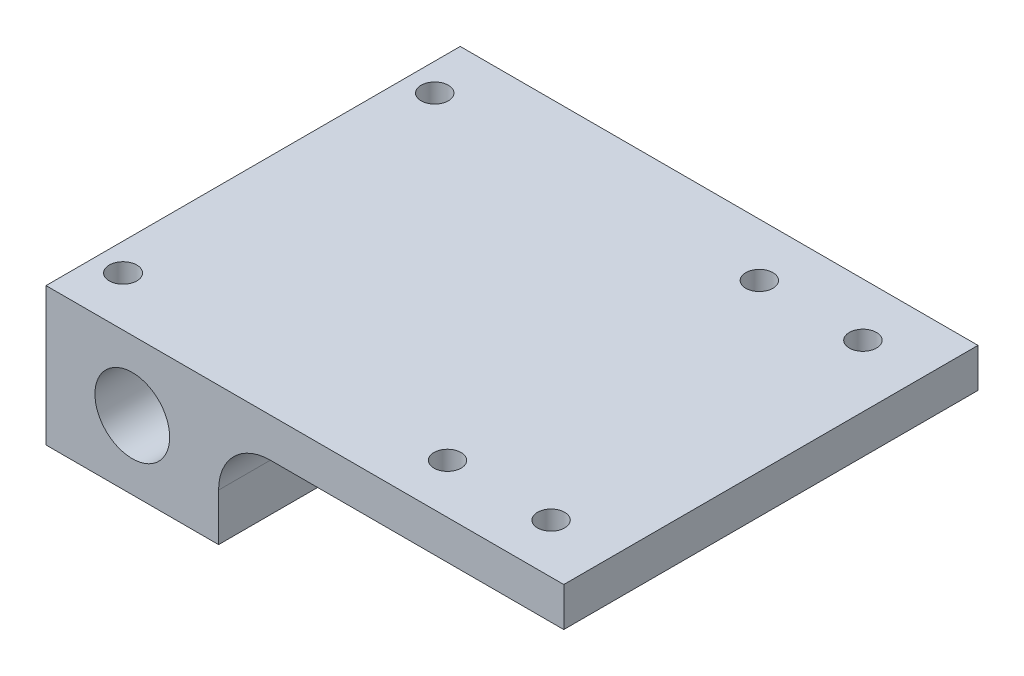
ISO-10303-21;
HEADER;
FILE_DESCRIPTION(('STEP AP214'),'2;1');
FILE_NAME('part.step','',(''),(''),'','','');
FILE_SCHEMA(('AUTOMOTIVE_DESIGN { 1 0 10303 214 1 1 1 1 }'));
ENDSEC;
DATA;
#1=APPLICATION_CONTEXT('core data for automotive mechanical design processes');
#2=APPLICATION_PROTOCOL_DEFINITION('international standard','automotive_design',2000,#1);
#3=PRODUCT_CONTEXT('',#1,'mechanical');
#4=PRODUCT('Part','Part','',(#3));
#5=PRODUCT_RELATED_PRODUCT_CATEGORY('part','',(#4));
#6=PRODUCT_DEFINITION_FORMATION('','',#4);
#7=PRODUCT_DEFINITION_CONTEXT('part definition',#1,'design');
#8=PRODUCT_DEFINITION('design','',#6,#7);
#9=PRODUCT_DEFINITION_SHAPE('','',#8);
#10=(LENGTH_UNIT() NAMED_UNIT(*) SI_UNIT(.MILLI.,.METRE.));
#11=(NAMED_UNIT(*) PLANE_ANGLE_UNIT() SI_UNIT($,.RADIAN.));
#12=(NAMED_UNIT(*) SI_UNIT($,.STERADIAN.) SOLID_ANGLE_UNIT());
#13=UNCERTAINTY_MEASURE_WITH_UNIT(LENGTH_MEASURE(1.E-05),#10,'distance_accuracy_value','');
#14=(GEOMETRIC_REPRESENTATION_CONTEXT(3) GLOBAL_UNCERTAINTY_ASSIGNED_CONTEXT((#13)) GLOBAL_UNIT_ASSIGNED_CONTEXT((#10,
#11,#12)) REPRESENTATION_CONTEXT('',''));
#15=CARTESIAN_POINT('',(0.,0.,0.));
#16=DIRECTION('',(0.,0.,1.));
#17=DIRECTION('',(1.,0.,0.));
#18=AXIS2_PLACEMENT_3D('',#15,#16,#17);
#19=CARTESIAN_POINT('',(-27.1241721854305,-5.05056291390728,30.48));
#20=DIRECTION('',(1.,0.,0.));
#21=DIRECTION('',(0.,0.,-1.));
#22=AXIS2_PLACEMENT_3D('',#19,#20,#21);
#23=PLANE('',#22);
#24=DIRECTION('',(0.,-1.,0.));
#25=VECTOR('',#24,1.);
#26=CARTESIAN_POINT('',(-27.1241721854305,-5.05056291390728,0.));
#27=LINE('',#26,#25);
#28=CARTESIAN_POINT('',(-27.1241721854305,5.10943708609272,0.));
#29=VERTEX_POINT('',#28);
#30=CARTESIAN_POINT('',(-27.1241721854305,-5.05056291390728,0.));
#31=VERTEX_POINT('',#30);
#32=EDGE_CURVE('E124',#29,#31,#27,.T.);
#33=ORIENTED_EDGE('',*,*,#32,.T.);
#34=DIRECTION('',(0.,0.,-1.));
#35=VECTOR('',#34,1.);
#36=CARTESIAN_POINT('',(-27.1241721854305,-5.05056291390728,30.48));
#37=LINE('',#36,#35);
#38=CARTESIAN_POINT('',(-27.1241721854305,-5.05056291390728,30.48));
#39=VERTEX_POINT('',#38);
#40=EDGE_CURVE('E11',#39,#31,#37,.T.);
#41=ORIENTED_EDGE('',*,*,#40,.F.);
#42=DIRECTION('',(0.,-1.,0.));
#43=VECTOR('',#42,1.);
#44=CARTESIAN_POINT('',(-27.1241721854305,-5.05056291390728,30.48));
#45=LINE('',#44,#43);
#46=CARTESIAN_POINT('',(-27.1241721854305,5.10943708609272,30.48));
#47=VERTEX_POINT('',#46);
#48=EDGE_CURVE('E136',#47,#39,#45,.T.);
#49=ORIENTED_EDGE('',*,*,#48,.F.);
#50=DIRECTION('',(0.,0.,-1.));
#51=VECTOR('',#50,1.);
#52=CARTESIAN_POINT('',(-27.1241721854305,5.10943708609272,30.48));
#53=LINE('',#52,#51);
#54=EDGE_CURVE('E120',#47,#29,#53,.T.);
#55=ORIENTED_EDGE('',*,*,#54,.T.);
#56=EDGE_LOOP('',(#33,#41,#49,#55));
#57=FACE_BOUND('',#56,.T.);
#58=ADVANCED_FACE('F33',(#57),#23,.F.);
#59=CARTESIAN_POINT('',(-14.4241721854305,-5.05056291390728,30.48));
#60=DIRECTION('',(0.,1.,0.));
#61=DIRECTION('',(-1.,0.,0.));
#62=AXIS2_PLACEMENT_3D('',#59,#60,#61);
#63=PLANE('',#62);
#64=CARTESIAN_POINT('',(-25.0921721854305,-5.05056291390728,3.90908800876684));
#65=DIRECTION('',(0.,1.,0.));
#66=DIRECTION('',(-1.,0.,0.));
#67=AXIS2_PLACEMENT_3D('',#64,#65,#66);
#68=CIRCLE('',#67,1.);
#69=CARTESIAN_POINT('',(-26.0921721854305,-5.05056291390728,3.90908800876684));
#70=VERTEX_POINT('',#69);
#71=EDGE_CURVE('E169',#70,#70,#68,.T.);
#72=ORIENTED_EDGE('',*,*,#71,.T.);
#73=EDGE_LOOP('',(#72));
#74=FACE_BOUND('',#73,.T.);
#75=CARTESIAN_POINT('',(-25.0921721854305,-5.05056291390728,26.8423791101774));
#76=DIRECTION('',(0.,1.,0.));
#77=DIRECTION('',(-1.,0.,0.));
#78=AXIS2_PLACEMENT_3D('',#75,#76,#77);
#79=CIRCLE('',#78,1.016);
#80=CARTESIAN_POINT('',(-26.1081721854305,-5.05056291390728,26.8423791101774));
#81=VERTEX_POINT('',#80);
#82=EDGE_CURVE('E163',#81,#81,#79,.T.);
#83=ORIENTED_EDGE('',*,*,#82,.T.);
#84=EDGE_LOOP('',(#83));
#85=FACE_BOUND('',#84,.T.);
#86=DIRECTION('',(1.,0.,0.));
#87=VECTOR('',#86,1.);
#88=CARTESIAN_POINT('',(-14.4241721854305,-5.05056291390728,0.));
#89=LINE('',#88,#87);
#90=CARTESIAN_POINT('',(-14.4241721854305,-5.05056291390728,0.));
#91=VERTEX_POINT('',#90);
#92=EDGE_CURVE('E127',#31,#91,#89,.T.);
#93=ORIENTED_EDGE('',*,*,#92,.T.);
#94=DIRECTION('',(0.,0.,-1.));
#95=VECTOR('',#94,1.);
#96=CARTESIAN_POINT('',(-14.4241721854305,-5.05056291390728,30.48));
#97=LINE('',#96,#95);
#98=CARTESIAN_POINT('',(-14.4241721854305,-5.05056291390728,30.48));
#99=VERTEX_POINT('',#98);
#100=EDGE_CURVE('E42',#99,#91,#97,.T.);
#101=ORIENTED_EDGE('',*,*,#100,.F.);
#102=DIRECTION('',(1.,0.,0.));
#103=VECTOR('',#102,1.);
#104=CARTESIAN_POINT('',(-14.4241721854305,-5.05056291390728,30.48));
#105=LINE('',#104,#103);
#106=EDGE_CURVE('E90',#39,#99,#105,.T.);
#107=ORIENTED_EDGE('',*,*,#106,.F.);
#108=ORIENTED_EDGE('',*,*,#40,.T.);
#109=EDGE_LOOP('',(#93,#101,#107,#108));
#110=FACE_BOUND('',#109,.T.);
#111=ADVANCED_FACE('F225',(#74,#85,#110),#63,.F.);
#112=CARTESIAN_POINT('',(-14.4241721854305,-1.57278145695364,30.48));
#113=DIRECTION('',(-1.,0.,0.));
#114=DIRECTION('',(0.,-1.,0.));
#115=AXIS2_PLACEMENT_3D('',#112,#113,#114);
#116=PLANE('',#115);
#117=DIRECTION('',(0.,1.,0.));
#118=VECTOR('',#117,1.);
#119=CARTESIAN_POINT('',(-14.4241721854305,-1.57278145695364,0.));
#120=LINE('',#119,#118);
#121=CARTESIAN_POINT('',(-14.4241721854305,-1.57278145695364,0.));
#122=VERTEX_POINT('',#121);
#123=EDGE_CURVE('E129',#91,#122,#120,.T.);
#124=ORIENTED_EDGE('',*,*,#123,.T.);
#125=DIRECTION('',(0.,0.,-1.));
#126=VECTOR('',#125,1.);
#127=CARTESIAN_POINT('',(-14.4241721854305,-1.57278145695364,30.48));
#128=LINE('',#127,#126);
#129=CARTESIAN_POINT('',(-14.4241721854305,-1.57278145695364,30.48));
#130=VERTEX_POINT('',#129);
#131=EDGE_CURVE('E140',#130,#122,#128,.T.);
#132=ORIENTED_EDGE('',*,*,#131,.F.);
#133=DIRECTION('',(0.,1.,0.));
#134=VECTOR('',#133,1.);
#135=CARTESIAN_POINT('',(-14.4241721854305,-1.57278145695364,30.48));
#136=LINE('',#135,#134);
#137=EDGE_CURVE('E149',#99,#130,#136,.T.);
#138=ORIENTED_EDGE('',*,*,#137,.F.);
#139=ORIENTED_EDGE('',*,*,#100,.T.);
#140=EDGE_LOOP('',(#124,#132,#138,#139));
#141=FACE_BOUND('',#140,.T.);
#142=ADVANCED_FACE('F147',(#141),#116,.F.);
#143=CARTESIAN_POINT('',(-10.6141721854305,-1.57278145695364,30.48));
#144=DIRECTION('',(0.,0.,-1.));
#145=DIRECTION('',(-1.,0.,0.));
#146=AXIS2_PLACEMENT_3D('',#143,#144,#145);
#147=CYLINDRICAL_SURFACE('',#146,3.81);
#148=CARTESIAN_POINT('',(-10.6141721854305,-1.57278145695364,0.));
#149=DIRECTION('',(0.,0.,-1.));
#150=DIRECTION('',(1.,0.,0.));
#151=AXIS2_PLACEMENT_3D('',#148,#149,#150);
#152=CIRCLE('',#151,3.81);
#153=CARTESIAN_POINT('',(-10.6141721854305,2.23721854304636,0.));
#154=VERTEX_POINT('',#153);
#155=EDGE_CURVE('E131',#122,#154,#152,.T.);
#156=ORIENTED_EDGE('',*,*,#155,.T.);
#157=DIRECTION('',(0.,0.,-1.));
#158=VECTOR('',#157,1.);
#159=CARTESIAN_POINT('',(-10.6141721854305,2.23721854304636,30.48));
#160=LINE('',#159,#158);
#161=CARTESIAN_POINT('',(-10.6141721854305,2.23721854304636,30.48));
#162=VERTEX_POINT('',#161);
#163=EDGE_CURVE('E115',#162,#154,#160,.T.);
#164=ORIENTED_EDGE('',*,*,#163,.F.);
#165=CARTESIAN_POINT('',(-10.6141721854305,-1.57278145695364,30.48));
#166=DIRECTION('',(0.,0.,-1.));
#167=DIRECTION('',(1.,0.,0.));
#168=AXIS2_PLACEMENT_3D('',#165,#166,#167);
#169=CIRCLE('',#168,3.81);
#170=EDGE_CURVE('E106',#130,#162,#169,.T.);
#171=ORIENTED_EDGE('',*,*,#170,.F.);
#172=ORIENTED_EDGE('',*,*,#131,.T.);
#173=EDGE_LOOP('',(#156,#164,#171,#172));
#174=FACE_BOUND('',#173,.T.);
#175=ADVANCED_FACE('F155',(#174),#147,.F.);
#176=CARTESIAN_POINT('',(10.9758278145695,2.23721854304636,30.48));
#177=DIRECTION('',(0.,1.,0.));
#178=DIRECTION('',(-1.,0.,0.));
#179=AXIS2_PLACEMENT_3D('',#176,#177,#178);
#180=PLANE('',#179);
#181=CARTESIAN_POINT('',(6.40382781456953,2.23721854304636,26.8423791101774));
#182=DIRECTION('',(0.,1.,0.));
#183=DIRECTION('',(-1.,0.,0.));
#184=AXIS2_PLACEMENT_3D('',#181,#182,#183);
#185=CIRCLE('',#184,1.);
#186=CARTESIAN_POINT('',(5.40382781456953,2.23721854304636,26.8423791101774));
#187=VERTEX_POINT('',#186);
#188=EDGE_CURVE('E193',#187,#187,#185,.T.);
#189=ORIENTED_EDGE('',*,*,#188,.T.);
#190=EDGE_LOOP('',(#189));
#191=FACE_BOUND('',#190,.T.);
#192=CARTESIAN_POINT('',(6.41582781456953,2.23721854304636,3.90908800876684));
#193=DIRECTION('',(0.,1.,0.));
#194=DIRECTION('',(-1.,0.,0.));
#195=AXIS2_PLACEMENT_3D('',#192,#193,#194);
#196=CIRCLE('',#195,1.);
#197=CARTESIAN_POINT('',(5.41582781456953,2.23721854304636,3.90908800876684));
#198=VERTEX_POINT('',#197);
#199=EDGE_CURVE('E187',#198,#198,#196,.T.);
#200=ORIENTED_EDGE('',*,*,#199,.T.);
#201=EDGE_LOOP('',(#200));
#202=FACE_BOUND('',#201,.T.);
#203=CARTESIAN_POINT('',(-1.20417218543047,2.23721854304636,3.90908800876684));
#204=DIRECTION('',(0.,1.,0.));
#205=DIRECTION('',(-1.,0.,0.));
#206=AXIS2_PLACEMENT_3D('',#203,#204,#205);
#207=CIRCLE('',#206,1.);
#208=CARTESIAN_POINT('',(-2.20417218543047,2.23721854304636,3.90908800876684));
#209=VERTEX_POINT('',#208);
#210=EDGE_CURVE('E181',#209,#209,#207,.T.);
#211=ORIENTED_EDGE('',*,*,#210,.T.);
#212=EDGE_LOOP('',(#211));
#213=FACE_BOUND('',#212,.T.);
#214=CARTESIAN_POINT('',(-1.21617218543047,2.23721854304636,26.8423791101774));
#215=DIRECTION('',(0.,1.,0.));
#216=DIRECTION('',(-1.,0.,0.));
#217=AXIS2_PLACEMENT_3D('',#214,#215,#216);
#218=CIRCLE('',#217,1.);
#219=CARTESIAN_POINT('',(-2.21617218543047,2.23721854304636,26.8423791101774));
#220=VERTEX_POINT('',#219);
#221=EDGE_CURVE('E175',#220,#220,#218,.T.);
#222=ORIENTED_EDGE('',*,*,#221,.T.);
#223=EDGE_LOOP('',(#222));
#224=FACE_BOUND('',#223,.T.);
#225=DIRECTION('',(1.,0.,0.));
#226=VECTOR('',#225,1.);
#227=CARTESIAN_POINT('',(10.9758278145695,2.23721854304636,0.));
#228=LINE('',#227,#226);
#229=CARTESIAN_POINT('',(10.9758278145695,2.23721854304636,0.));
#230=VERTEX_POINT('',#229);
#231=EDGE_CURVE('E114',#154,#230,#228,.T.);
#232=ORIENTED_EDGE('',*,*,#231,.T.);
#233=DIRECTION('',(0.,0.,-1.));
#234=VECTOR('',#233,1.);
#235=CARTESIAN_POINT('',(10.9758278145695,2.23721854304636,30.48));
#236=LINE('',#235,#234);
#237=CARTESIAN_POINT('',(10.9758278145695,2.23721854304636,30.48));
#238=VERTEX_POINT('',#237);
#239=EDGE_CURVE('E111',#238,#230,#236,.T.);
#240=ORIENTED_EDGE('',*,*,#239,.F.);
#241=DIRECTION('',(1.,0.,0.));
#242=VECTOR('',#241,1.);
#243=CARTESIAN_POINT('',(10.9758278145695,2.23721854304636,30.48));
#244=LINE('',#243,#242);
#245=EDGE_CURVE('E100',#162,#238,#244,.T.);
#246=ORIENTED_EDGE('',*,*,#245,.F.);
#247=ORIENTED_EDGE('',*,*,#163,.T.);
#248=EDGE_LOOP('',(#232,#240,#246,#247));
#249=FACE_BOUND('',#248,.T.);
#250=ADVANCED_FACE('F112',(#191,#202,#213,#224,#249),#180,.F.);
#251=CARTESIAN_POINT('',(10.9758278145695,5.10943708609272,30.48));
#252=DIRECTION('',(-1.,0.,0.));
#253=DIRECTION('',(0.,0.,1.));
#254=AXIS2_PLACEMENT_3D('',#251,#252,#253);
#255=PLANE('',#254);
#256=DIRECTION('',(0.,1.,0.));
#257=VECTOR('',#256,1.);
#258=CARTESIAN_POINT('',(10.9758278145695,5.10943708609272,0.));
#259=LINE('',#258,#257);
#260=CARTESIAN_POINT('',(10.9758278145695,5.10943708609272,0.));
#261=VERTEX_POINT('',#260);
#262=EDGE_CURVE('E76',#230,#261,#259,.T.);
#263=ORIENTED_EDGE('',*,*,#262,.T.);
#264=DIRECTION('',(0.,0.,-1.));
#265=VECTOR('',#264,1.);
#266=CARTESIAN_POINT('',(10.9758278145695,5.10943708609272,30.48));
#267=LINE('',#266,#265);
#268=CARTESIAN_POINT('',(10.9758278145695,5.10943708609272,30.48));
#269=VERTEX_POINT('',#268);
#270=EDGE_CURVE('E116',#269,#261,#267,.T.);
#271=ORIENTED_EDGE('',*,*,#270,.F.);
#272=DIRECTION('',(0.,1.,0.));
#273=VECTOR('',#272,1.);
#274=CARTESIAN_POINT('',(10.9758278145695,5.10943708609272,30.48));
#275=LINE('',#274,#273);
#276=EDGE_CURVE('E104',#238,#269,#275,.T.);
#277=ORIENTED_EDGE('',*,*,#276,.F.);
#278=ORIENTED_EDGE('',*,*,#239,.T.);
#279=EDGE_LOOP('',(#263,#271,#277,#278));
#280=FACE_BOUND('',#279,.T.);
#281=ADVANCED_FACE('F118',(#280),#255,.F.);
#282=CARTESIAN_POINT('',(-27.1241721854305,5.10943708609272,30.48));
#283=DIRECTION('',(0.,-1.,0.));
#284=DIRECTION('',(0.,0.,-1.));
#285=AXIS2_PLACEMENT_3D('',#282,#283,#284);
#286=PLANE('',#285);
#287=CARTESIAN_POINT('',(6.40382781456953,5.10943708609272,26.8423791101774));
#288=DIRECTION('',(0.,1.,0.));
#289=DIRECTION('',(0.,0.,1.));
#290=AXIS2_PLACEMENT_3D('',#287,#288,#289);
#291=CIRCLE('',#290,1.);
#292=CARTESIAN_POINT('',(6.40382781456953,5.10943708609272,27.8423791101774));
#293=VERTEX_POINT('',#292);
#294=EDGE_CURVE('E196',#293,#293,#291,.T.);
#295=ORIENTED_EDGE('',*,*,#294,.F.);
#296=EDGE_LOOP('',(#295));
#297=FACE_BOUND('',#296,.T.);
#298=CARTESIAN_POINT('',(6.41582781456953,5.10943708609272,3.90908800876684));
#299=DIRECTION('',(0.,1.,0.));
#300=DIRECTION('',(0.,0.,1.));
#301=AXIS2_PLACEMENT_3D('',#298,#299,#300);
#302=CIRCLE('',#301,1.);
#303=CARTESIAN_POINT('',(6.41582781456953,5.10943708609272,4.90908800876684));
#304=VERTEX_POINT('',#303);
#305=EDGE_CURVE('E190',#304,#304,#302,.T.);
#306=ORIENTED_EDGE('',*,*,#305,.F.);
#307=EDGE_LOOP('',(#306));
#308=FACE_BOUND('',#307,.T.);
#309=CARTESIAN_POINT('',(-1.20417218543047,5.10943708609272,3.90908800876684));
#310=DIRECTION('',(0.,1.,0.));
#311=DIRECTION('',(0.,0.,1.));
#312=AXIS2_PLACEMENT_3D('',#309,#310,#311);
#313=CIRCLE('',#312,1.);
#314=CARTESIAN_POINT('',(-1.20417218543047,5.10943708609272,4.90908800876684));
#315=VERTEX_POINT('',#314);
#316=EDGE_CURVE('E184',#315,#315,#313,.T.);
#317=ORIENTED_EDGE('',*,*,#316,.F.);
#318=EDGE_LOOP('',(#317));
#319=FACE_BOUND('',#318,.T.);
#320=CARTESIAN_POINT('',(-1.21617218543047,5.10943708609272,26.8423791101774));
#321=DIRECTION('',(0.,1.,0.));
#322=DIRECTION('',(0.,0.,1.));
#323=AXIS2_PLACEMENT_3D('',#320,#321,#322);
#324=CIRCLE('',#323,1.);
#325=CARTESIAN_POINT('',(-1.21617218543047,5.10943708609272,27.8423791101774));
#326=VERTEX_POINT('',#325);
#327=EDGE_CURVE('E178',#326,#326,#324,.T.);
#328=ORIENTED_EDGE('',*,*,#327,.F.);
#329=EDGE_LOOP('',(#328));
#330=FACE_BOUND('',#329,.T.);
#331=CARTESIAN_POINT('',(-25.0921721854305,5.10943708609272,3.90908800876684));
#332=DIRECTION('',(0.,1.,0.));
#333=DIRECTION('',(0.,0.,1.));
#334=AXIS2_PLACEMENT_3D('',#331,#332,#333);
#335=CIRCLE('',#334,1.);
#336=CARTESIAN_POINT('',(-25.0921721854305,5.10943708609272,4.90908800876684));
#337=VERTEX_POINT('',#336);
#338=EDGE_CURVE('E172',#337,#337,#335,.T.);
#339=ORIENTED_EDGE('',*,*,#338,.F.);
#340=EDGE_LOOP('',(#339));
#341=FACE_BOUND('',#340,.T.);
#342=CARTESIAN_POINT('',(-25.0921721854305,5.10943708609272,26.8423791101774));
#343=DIRECTION('',(0.,1.,0.));
#344=DIRECTION('',(0.,0.,1.));
#345=AXIS2_PLACEMENT_3D('',#342,#343,#344);
#346=CIRCLE('',#345,1.016);
#347=CARTESIAN_POINT('',(-25.0921721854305,5.10943708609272,27.8583791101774));
#348=VERTEX_POINT('',#347);
#349=EDGE_CURVE('E166',#348,#348,#346,.T.);
#350=ORIENTED_EDGE('',*,*,#349,.F.);
#351=EDGE_LOOP('',(#350));
#352=FACE_BOUND('',#351,.T.);
#353=DIRECTION('',(-1.,0.,0.));
#354=VECTOR('',#353,1.);
#355=CARTESIAN_POINT('',(-27.1241721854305,5.10943708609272,0.));
#356=LINE('',#355,#354);
#357=EDGE_CURVE('E82',#261,#29,#356,.T.);
#358=ORIENTED_EDGE('',*,*,#357,.T.);
#359=ORIENTED_EDGE('',*,*,#54,.F.);
#360=DIRECTION('',(-1.,0.,0.));
#361=VECTOR('',#360,1.);
#362=CARTESIAN_POINT('',(-27.1241721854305,5.10943708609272,30.48));
#363=LINE('',#362,#361);
#364=EDGE_CURVE('E50',#269,#47,#363,.T.);
#365=ORIENTED_EDGE('',*,*,#364,.F.);
#366=ORIENTED_EDGE('',*,*,#270,.T.);
#367=EDGE_LOOP('',(#358,#359,#365,#366));
#368=FACE_BOUND('',#367,.T.);
#369=ADVANCED_FACE('F203',(#297,#308,#319,#330,#341,#352,#368),#286,.F.);
#370=CARTESIAN_POINT('',(-10.6141721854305,-1.57278145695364,30.48));
#371=DIRECTION('',(0.,0.,1.));
#372=DIRECTION('',(1.,0.,0.));
#373=AXIS2_PLACEMENT_3D('',#370,#371,#372);
#374=PLANE('',#373);
#375=CARTESIAN_POINT('',(-20.7741721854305,0.,30.48));
#376=DIRECTION('',(0.,0.,1.));
#377=DIRECTION('',(1.,0.,0.));
#378=AXIS2_PLACEMENT_3D('',#375,#376,#377);
#379=CIRCLE('',#378,2.75);
#380=CARTESIAN_POINT('',(-18.0241721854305,0.,30.48));
#381=VERTEX_POINT('',#380);
#382=EDGE_CURVE('E160',#381,#381,#379,.T.);
#383=ORIENTED_EDGE('',*,*,#382,.F.);
#384=EDGE_LOOP('',(#383));
#385=FACE_BOUND('',#384,.T.);
#386=ORIENTED_EDGE('',*,*,#48,.T.);
#387=ORIENTED_EDGE('',*,*,#106,.T.);
#388=ORIENTED_EDGE('',*,*,#137,.T.);
#389=ORIENTED_EDGE('',*,*,#170,.T.);
#390=ORIENTED_EDGE('',*,*,#245,.T.);
#391=ORIENTED_EDGE('',*,*,#276,.T.);
#392=ORIENTED_EDGE('',*,*,#364,.T.);
#393=EDGE_LOOP('',(#386,#387,#388,#389,#390,#391,#392));
#394=FACE_BOUND('',#393,.T.);
#395=ADVANCED_FACE('F102',(#385,#394),#374,.T.);
#396=CARTESIAN_POINT('',(-10.6141721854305,-1.57278145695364,0.));
#397=DIRECTION('',(0.,0.,1.));
#398=DIRECTION('',(1.,0.,0.));
#399=AXIS2_PLACEMENT_3D('',#396,#397,#398);
#400=PLANE('',#399);
#401=CARTESIAN_POINT('',(-20.7741721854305,0.,0.));
#402=DIRECTION('',(0.,0.,1.));
#403=DIRECTION('',(1.,0.,0.));
#404=AXIS2_PLACEMENT_3D('',#401,#402,#403);
#405=CIRCLE('',#404,2.75);
#406=CARTESIAN_POINT('',(-18.0241721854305,0.,0.));
#407=VERTEX_POINT('',#406);
#408=EDGE_CURVE('E36',#407,#407,#405,.T.);
#409=ORIENTED_EDGE('',*,*,#408,.T.);
#410=EDGE_LOOP('',(#409));
#411=FACE_BOUND('',#410,.T.);
#412=ORIENTED_EDGE('',*,*,#32,.F.);
#413=ORIENTED_EDGE('',*,*,#357,.F.);
#414=ORIENTED_EDGE('',*,*,#262,.F.);
#415=ORIENTED_EDGE('',*,*,#231,.F.);
#416=ORIENTED_EDGE('',*,*,#155,.F.);
#417=ORIENTED_EDGE('',*,*,#123,.F.);
#418=ORIENTED_EDGE('',*,*,#92,.F.);
#419=EDGE_LOOP('',(#412,#413,#414,#415,#416,#417,#418));
#420=FACE_BOUND('',#419,.T.);
#421=ADVANCED_FACE('F153',(#411,#420),#400,.F.);
#422=CARTESIAN_POINT('',(-20.7741721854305,0.,-10.922));
#423=DIRECTION('',(0.,0.,1.));
#424=DIRECTION('',(1.,0.,0.));
#425=AXIS2_PLACEMENT_3D('',#422,#423,#424);
#426=CYLINDRICAL_SURFACE('',#425,2.75);
#427=ORIENTED_EDGE('',*,*,#382,.T.);
#428=EDGE_LOOP('',(#427));
#429=FACE_BOUND('',#428,.T.);
#430=ORIENTED_EDGE('',*,*,#408,.F.);
#431=EDGE_LOOP('',(#430));
#432=FACE_BOUND('',#431,.T.);
#433=ADVANCED_FACE('F221',(#429,#432),#426,.F.);
#434=CARTESIAN_POINT('',(-25.0921721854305,-36.2925629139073,26.8423791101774));
#435=DIRECTION('',(0.,1.,0.));
#436=DIRECTION('',(0.,0.,1.));
#437=AXIS2_PLACEMENT_3D('',#434,#435,#436);
#438=CYLINDRICAL_SURFACE('',#437,1.016);
#439=ORIENTED_EDGE('',*,*,#349,.T.);
#440=EDGE_LOOP('',(#439));
#441=FACE_BOUND('',#440,.T.);
#442=ORIENTED_EDGE('',*,*,#82,.F.);
#443=EDGE_LOOP('',(#442));
#444=FACE_BOUND('',#443,.T.);
#445=ADVANCED_FACE('F217',(#441,#444),#438,.F.);
#446=CARTESIAN_POINT('',(-25.0921721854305,-36.2925629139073,3.90908800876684));
#447=DIRECTION('',(0.,1.,0.));
#448=DIRECTION('',(0.,0.,1.));
#449=AXIS2_PLACEMENT_3D('',#446,#447,#448);
#450=CYLINDRICAL_SURFACE('',#449,1.);
#451=ORIENTED_EDGE('',*,*,#338,.T.);
#452=EDGE_LOOP('',(#451));
#453=FACE_BOUND('',#452,.T.);
#454=ORIENTED_EDGE('',*,*,#71,.F.);
#455=EDGE_LOOP('',(#454));
#456=FACE_BOUND('',#455,.T.);
#457=ADVANCED_FACE('F220',(#453,#456),#450,.F.);
#458=CARTESIAN_POINT('',(-1.21617218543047,-36.2925629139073,26.8423791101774));
#459=DIRECTION('',(0.,1.,0.));
#460=DIRECTION('',(0.,0.,1.));
#461=AXIS2_PLACEMENT_3D('',#458,#459,#460);
#462=CYLINDRICAL_SURFACE('',#461,1.);
#463=ORIENTED_EDGE('',*,*,#327,.T.);
#464=EDGE_LOOP('',(#463));
#465=FACE_BOUND('',#464,.T.);
#466=ORIENTED_EDGE('',*,*,#221,.F.);
#467=EDGE_LOOP('',(#466));
#468=FACE_BOUND('',#467,.T.);
#469=ADVANCED_FACE('F298',(#465,#468),#462,.F.);
#470=CARTESIAN_POINT('',(-1.20417218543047,-36.2925629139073,3.90908800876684));
#471=DIRECTION('',(0.,1.,0.));
#472=DIRECTION('',(0.,0.,1.));
#473=AXIS2_PLACEMENT_3D('',#470,#471,#472);
#474=CYLINDRICAL_SURFACE('',#473,1.);
#475=ORIENTED_EDGE('',*,*,#316,.T.);
#476=EDGE_LOOP('',(#475));
#477=FACE_BOUND('',#476,.T.);
#478=ORIENTED_EDGE('',*,*,#210,.F.);
#479=EDGE_LOOP('',(#478));
#480=FACE_BOUND('',#479,.T.);
#481=ADVANCED_FACE('F306',(#477,#480),#474,.F.);
#482=CARTESIAN_POINT('',(6.41582781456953,-36.2925629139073,3.90908800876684));
#483=DIRECTION('',(0.,1.,0.));
#484=DIRECTION('',(0.,0.,1.));
#485=AXIS2_PLACEMENT_3D('',#482,#483,#484);
#486=CYLINDRICAL_SURFACE('',#485,1.);
#487=ORIENTED_EDGE('',*,*,#305,.T.);
#488=EDGE_LOOP('',(#487));
#489=FACE_BOUND('',#488,.T.);
#490=ORIENTED_EDGE('',*,*,#199,.F.);
#491=EDGE_LOOP('',(#490));
#492=FACE_BOUND('',#491,.T.);
#493=ADVANCED_FACE('F314',(#489,#492),#486,.F.);
#494=CARTESIAN_POINT('',(6.40382781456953,-36.2925629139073,26.8423791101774));
#495=DIRECTION('',(0.,1.,0.));
#496=DIRECTION('',(0.,0.,1.));
#497=AXIS2_PLACEMENT_3D('',#494,#495,#496);
#498=CYLINDRICAL_SURFACE('',#497,1.);
#499=ORIENTED_EDGE('',*,*,#294,.T.);
#500=EDGE_LOOP('',(#499));
#501=FACE_BOUND('',#500,.T.);
#502=ORIENTED_EDGE('',*,*,#188,.F.);
#503=EDGE_LOOP('',(#502));
#504=FACE_BOUND('',#503,.T.);
#505=ADVANCED_FACE('F200',(#501,#504),#498,.F.);
#506=CLOSED_SHELL('',(#58,#111,#142,#175,#250,#281,#369,#395,#421,#433,#445,#457,#469,#481,#493,#505));
#507=MANIFOLD_SOLID_BREP('B2',#506);
#508=ADVANCED_BREP_SHAPE_REPRESENTATION('',(#18,#507),#14);
#509=SHAPE_DEFINITION_REPRESENTATION(#9,#508);
ENDSEC;
END-ISO-10303-21;
